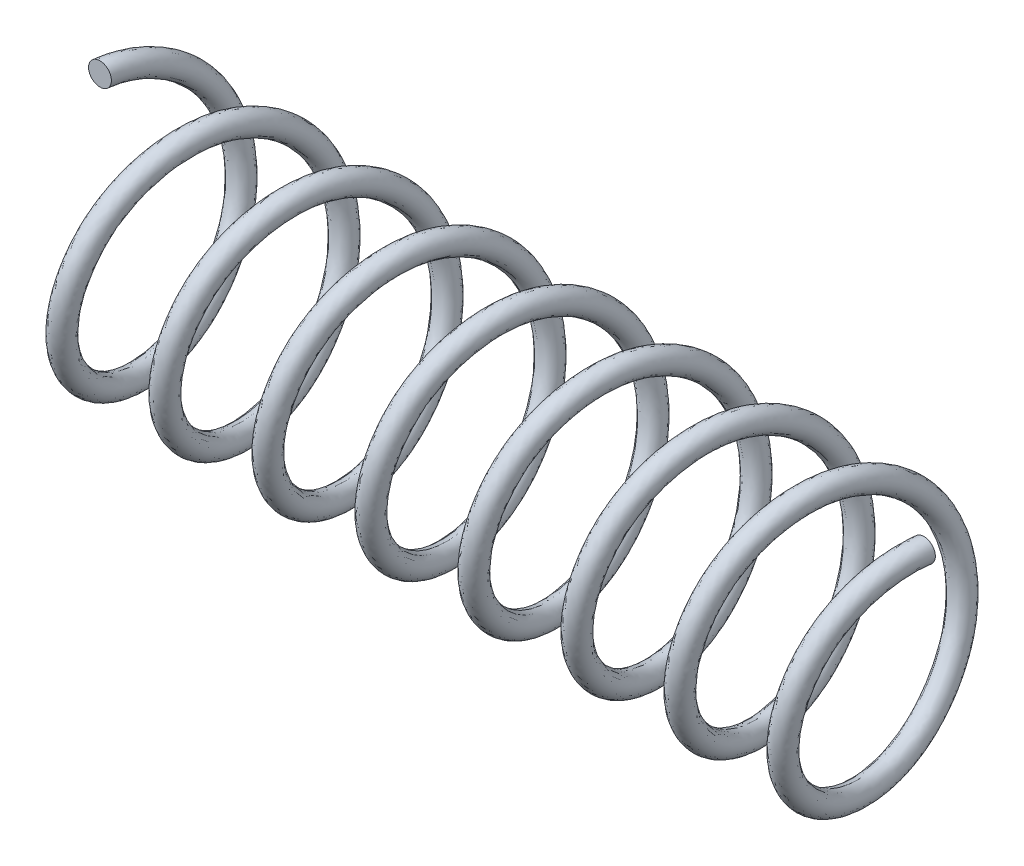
ISO-10303-21;
HEADER;
FILE_DESCRIPTION(('STEP AP214'),'2;1');
FILE_NAME('part.step','',(''),(''),'','','');
FILE_SCHEMA(('AUTOMOTIVE_DESIGN { 1 0 10303 214 1 1 1 1 }'));
ENDSEC;
DATA;
#1=APPLICATION_CONTEXT('core data for automotive mechanical design processes');
#2=APPLICATION_PROTOCOL_DEFINITION('international standard','automotive_design',2000,#1);
#3=PRODUCT_CONTEXT('',#1,'mechanical');
#4=PRODUCT('Part','Part','',(#3));
#5=PRODUCT_RELATED_PRODUCT_CATEGORY('part','',(#4));
#6=PRODUCT_DEFINITION_FORMATION('','',#4);
#7=PRODUCT_DEFINITION_CONTEXT('part definition',#1,'design');
#8=PRODUCT_DEFINITION('design','',#6,#7);
#9=PRODUCT_DEFINITION_SHAPE('','',#8);
#10=(LENGTH_UNIT() NAMED_UNIT(*) SI_UNIT(.MILLI.,.METRE.));
#11=(NAMED_UNIT(*) PLANE_ANGLE_UNIT() SI_UNIT($,.RADIAN.));
#12=(NAMED_UNIT(*) SI_UNIT($,.STERADIAN.) SOLID_ANGLE_UNIT());
#13=UNCERTAINTY_MEASURE_WITH_UNIT(LENGTH_MEASURE(1.E-05),#10,'distance_accuracy_value','');
#14=(GEOMETRIC_REPRESENTATION_CONTEXT(3) GLOBAL_UNCERTAINTY_ASSIGNED_CONTEXT((#13)) GLOBAL_UNIT_ASSIGNED_CONTEXT((#10,
#11,#12)) REPRESENTATION_CONTEXT('',''));
#15=CARTESIAN_POINT('',(0.,0.,0.));
#16=DIRECTION('',(0.,0.,1.));
#17=DIRECTION('',(1.,0.,0.));
#18=AXIS2_PLACEMENT_3D('',#15,#16,#17);
#19=CARTESIAN_POINT('',(-5.80000000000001,6.,-2.23454805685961E-13));
#20=DIRECTION('',(0.,1.1172740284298E-13,1.));
#21=DIRECTION('',(1.,0.,0.));
#22=AXIS2_PLACEMENT_3D('',#19,#20,#21);
#23=PLANE('',#22);
#24=CARTESIAN_POINT('',(-5.80000000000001,6.,-2.23454805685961E-13));
#25=DIRECTION('',(0.,1.1172740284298E-13,1.));
#26=DIRECTION('',(1.,0.,0.));
#27=AXIS2_PLACEMENT_3D('',#24,#25,#26);
#28=CIRCLE('',#27,0.199999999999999);
#29=CARTESIAN_POINT('',(-5.60000000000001,6.,-2.23454805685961E-13));
#30=VERTEX_POINT('',#29);
#31=EDGE_CURVE('E41',#30,#30,#28,.T.);
#32=ORIENTED_EDGE('',*,*,#31,.F.);
#33=EDGE_LOOP('',(#32));
#34=FACE_BOUND('',#33,.T.);
#35=ADVANCED_FACE('F34',(#34),#23,.F.);
#36=CARTESIAN_POINT('',(-20.2499998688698,6.,0.));
#37=DIRECTION('',(0.,0.,1.));
#38=DIRECTION('',(1.,0.,0.));
#39=AXIS2_PLACEMENT_3D('',#36,#37,#38);
#40=PLANE('',#39);
#41=CARTESIAN_POINT('',(-20.2499998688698,6.,0.));
#42=DIRECTION('',(0.,0.,1.));
#43=DIRECTION('',(1.,0.,0.));
#44=AXIS2_PLACEMENT_3D('',#41,#42,#43);
#45=CIRCLE('',#44,0.199999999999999);
#46=CARTESIAN_POINT('',(-20.0499998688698,6.,0.));
#47=VERTEX_POINT('',#46);
#48=EDGE_CURVE('E11',#47,#47,#45,.T.);
#49=ORIENTED_EDGE('',*,*,#48,.T.);
#50=EDGE_LOOP('',(#49));
#51=FACE_BOUND('',#50,.T.);
#52=ADVANCED_FACE('F48',(#51),#40,.T.);
#53=CARTESIAN_POINT('',(-5.60000000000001,6.,-2.23454805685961E-13));
#54=CARTESIAN_POINT('',(-5.7505208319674,6.00000000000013,1.15470053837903));
#55=CARTESIAN_POINT('',(-5.90104166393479,5.0000000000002,1.73205080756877));
#56=CARTESIAN_POINT('',(-6.05156249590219,4.00000000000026,2.3094010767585));
#57=CARTESIAN_POINT('',(-6.20208332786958,3.00000000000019,1.73205080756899));
#58=CARTESIAN_POINT('',(-6.35260415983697,2.00000000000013,1.15470053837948));
#59=CARTESIAN_POINT('',(-6.50312499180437,2.,2.2369973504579E-13));
#60=CARTESIAN_POINT('',(-6.65364582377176,1.99999999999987,-1.15470053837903));
#61=CARTESIAN_POINT('',(-6.80416665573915,2.99999999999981,-1.73205080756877));
#62=CARTESIAN_POINT('',(-6.95468748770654,3.99999999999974,-2.3094010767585));
#63=CARTESIAN_POINT('',(-7.10520831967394,4.99999999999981,-1.73205080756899));
#64=CARTESIAN_POINT('',(-7.25572915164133,5.99999999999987,-1.15470053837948));
#65=CARTESIAN_POINT('',(-7.40624998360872,6.,-2.23454805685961E-13));
#66=CARTESIAN_POINT('',(-7.55677081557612,6.00000000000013,1.15470053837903));
#67=CARTESIAN_POINT('',(-7.70729164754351,5.0000000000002,1.73205080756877));
#68=CARTESIAN_POINT('',(-7.8578124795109,4.00000000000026,2.3094010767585));
#69=CARTESIAN_POINT('',(-8.0083333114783,3.00000000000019,1.73205080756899));
#70=CARTESIAN_POINT('',(-8.15885414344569,2.00000000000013,1.15470053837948));
#71=CARTESIAN_POINT('',(-8.30937497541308,2.,2.2369973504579E-13));
#72=CARTESIAN_POINT('',(-8.45989580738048,1.99999999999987,-1.15470053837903));
#73=CARTESIAN_POINT('',(-8.61041663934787,2.99999999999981,-1.73205080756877));
#74=CARTESIAN_POINT('',(-8.76093747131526,3.99999999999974,-2.3094010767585));
#75=CARTESIAN_POINT('',(-8.91145830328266,4.99999999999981,-1.73205080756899));
#76=CARTESIAN_POINT('',(-9.06197913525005,5.99999999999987,-1.15470053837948));
#77=CARTESIAN_POINT('',(-9.21249996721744,6.,-2.23454805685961E-13));
#78=CARTESIAN_POINT('',(-9.36302079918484,6.00000000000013,1.15470053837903));
#79=CARTESIAN_POINT('',(-9.51354163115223,5.00000000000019,1.73205080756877));
#80=CARTESIAN_POINT('',(-9.66406246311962,4.00000000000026,2.3094010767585));
#81=CARTESIAN_POINT('',(-9.81458329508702,3.00000000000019,1.73205080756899));
#82=CARTESIAN_POINT('',(-9.96510412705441,2.00000000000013,1.15470053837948));
#83=CARTESIAN_POINT('',(-10.1156249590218,2.,2.2369973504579E-13));
#84=CARTESIAN_POINT('',(-10.2661457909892,1.99999999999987,-1.15470053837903));
#85=CARTESIAN_POINT('',(-10.4166666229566,2.99999999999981,-1.73205080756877));
#86=CARTESIAN_POINT('',(-10.567187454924,3.99999999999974,-2.3094010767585));
#87=CARTESIAN_POINT('',(-10.7177082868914,4.99999999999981,-1.73205080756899));
#88=CARTESIAN_POINT('',(-10.8682291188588,5.99999999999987,-1.15470053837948));
#89=CARTESIAN_POINT('',(-11.0187499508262,6.,-2.23454805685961E-13));
#90=CARTESIAN_POINT('',(-11.1692707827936,6.00000000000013,1.15470053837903));
#91=CARTESIAN_POINT('',(-11.3197916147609,5.00000000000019,1.73205080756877));
#92=CARTESIAN_POINT('',(-11.4703124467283,4.00000000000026,2.3094010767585));
#93=CARTESIAN_POINT('',(-11.6208332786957,3.00000000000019,1.73205080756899));
#94=CARTESIAN_POINT('',(-11.7713541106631,2.00000000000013,1.15470053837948));
#95=CARTESIAN_POINT('',(-11.9218749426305,2.,2.2369973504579E-13));
#96=CARTESIAN_POINT('',(-12.0723957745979,1.99999999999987,-1.15470053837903));
#97=CARTESIAN_POINT('',(-12.2229166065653,2.99999999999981,-1.73205080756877));
#98=CARTESIAN_POINT('',(-12.3734374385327,3.99999999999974,-2.3094010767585));
#99=CARTESIAN_POINT('',(-12.5239582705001,4.99999999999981,-1.73205080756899));
#100=CARTESIAN_POINT('',(-12.6744791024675,5.99999999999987,-1.15470053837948));
#101=CARTESIAN_POINT('',(-12.8249999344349,6.,-2.23454805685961E-13));
#102=CARTESIAN_POINT('',(-12.9755207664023,6.00000000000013,1.15470053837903));
#103=CARTESIAN_POINT('',(-13.1260415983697,5.00000000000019,1.73205080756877));
#104=CARTESIAN_POINT('',(-13.2765624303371,4.00000000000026,2.3094010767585));
#105=CARTESIAN_POINT('',(-13.4270832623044,3.00000000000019,1.73205080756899));
#106=CARTESIAN_POINT('',(-13.5776040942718,2.00000000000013,1.15470053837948));
#107=CARTESIAN_POINT('',(-13.7281249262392,2.,2.2369973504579E-13));
#108=CARTESIAN_POINT('',(-13.8786457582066,1.99999999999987,-1.15470053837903));
#109=CARTESIAN_POINT('',(-14.029166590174,2.99999999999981,-1.73205080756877));
#110=CARTESIAN_POINT('',(-14.1796874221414,3.99999999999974,-2.3094010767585));
#111=CARTESIAN_POINT('',(-14.3302082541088,4.99999999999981,-1.73205080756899));
#112=CARTESIAN_POINT('',(-14.4807290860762,5.99999999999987,-1.15470053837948));
#113=CARTESIAN_POINT('',(-14.6312499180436,6.,-2.23454805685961E-13));
#114=CARTESIAN_POINT('',(-14.781770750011,6.00000000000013,1.15470053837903));
#115=CARTESIAN_POINT('',(-14.9322915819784,5.00000000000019,1.73205080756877));
#116=CARTESIAN_POINT('',(-15.0828124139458,4.00000000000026,2.3094010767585));
#117=CARTESIAN_POINT('',(-15.2333332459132,3.00000000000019,1.73205080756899));
#118=CARTESIAN_POINT('',(-15.3838540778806,2.00000000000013,1.15470053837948));
#119=CARTESIAN_POINT('',(-15.534374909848,2.,2.2369973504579E-13));
#120=CARTESIAN_POINT('',(-15.6848957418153,1.99999999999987,-1.15470053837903));
#121=CARTESIAN_POINT('',(-15.8354165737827,2.9999999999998,-1.73205080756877));
#122=CARTESIAN_POINT('',(-15.9859374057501,3.99999999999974,-2.3094010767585));
#123=CARTESIAN_POINT('',(-16.1364582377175,4.99999999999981,-1.73205080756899));
#124=CARTESIAN_POINT('',(-16.2869790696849,5.99999999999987,-1.15470053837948));
#125=CARTESIAN_POINT('',(-16.4374999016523,6.,-2.23454805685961E-13));
#126=CARTESIAN_POINT('',(-16.5880207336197,6.00000000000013,1.15470053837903));
#127=CARTESIAN_POINT('',(-16.7385415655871,5.00000000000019,1.73205080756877));
#128=CARTESIAN_POINT('',(-16.8890623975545,4.00000000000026,2.3094010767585));
#129=CARTESIAN_POINT('',(-17.0395832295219,3.00000000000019,1.73205080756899));
#130=CARTESIAN_POINT('',(-17.1901040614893,2.00000000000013,1.15470053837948));
#131=CARTESIAN_POINT('',(-17.3406248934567,2.,2.2369973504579E-13));
#132=CARTESIAN_POINT('',(-17.4911457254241,1.99999999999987,-1.15470053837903));
#133=CARTESIAN_POINT('',(-17.6416665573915,2.9999999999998,-1.73205080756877));
#134=CARTESIAN_POINT('',(-17.7921873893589,3.99999999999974,-2.3094010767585));
#135=CARTESIAN_POINT('',(-17.9427082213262,4.9999999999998,-1.73205080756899));
#136=CARTESIAN_POINT('',(-18.0932290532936,5.99999999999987,-1.15470053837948));
#137=CARTESIAN_POINT('',(-18.243749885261,6.,-2.23454805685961E-13));
#138=CARTESIAN_POINT('',(-18.3942707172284,6.00000000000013,1.15470053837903));
#139=CARTESIAN_POINT('',(-18.5447915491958,5.00000000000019,1.73205080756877));
#140=CARTESIAN_POINT('',(-18.6953123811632,4.00000000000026,2.3094010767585));
#141=CARTESIAN_POINT('',(-18.8458332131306,3.00000000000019,1.73205080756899));
#142=CARTESIAN_POINT('',(-18.996354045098,2.00000000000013,1.15470053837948));
#143=CARTESIAN_POINT('',(-19.1468748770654,2.,2.2369973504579E-13));
#144=CARTESIAN_POINT('',(-19.2973957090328,1.99999999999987,-1.15470053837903));
#145=CARTESIAN_POINT('',(-19.4479165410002,2.9999999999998,-1.73205080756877));
#146=CARTESIAN_POINT('',(-19.5984373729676,3.99999999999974,-2.3094010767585));
#147=CARTESIAN_POINT('',(-19.748958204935,4.9999999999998,-1.73205080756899));
#148=CARTESIAN_POINT('',(-19.8994790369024,5.99999999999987,-1.15470053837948));
#149=CARTESIAN_POINT('',(-20.0499998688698,6.,-2.23454805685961E-13));
#150=CARTESIAN_POINT('',(-5.60000000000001,6.4,-2.68145766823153E-13));
#151=CARTESIAN_POINT('',(-5.7505208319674,6.40000000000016,1.38564064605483));
#152=CARTESIAN_POINT('',(-5.90104166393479,5.20000000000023,2.07846096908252));
#153=CARTESIAN_POINT('',(-6.05156249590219,4.00000000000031,2.7712812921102));
#154=CARTESIAN_POINT('',(-6.20208332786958,2.80000000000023,2.07846096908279));
#155=CARTESIAN_POINT('',(-6.35260415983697,1.60000000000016,1.38564064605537));
#156=CARTESIAN_POINT('',(-6.50312499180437,1.6,2.68439682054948E-13));
#157=CARTESIAN_POINT('',(-6.65364582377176,1.59999999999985,-1.38564064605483));
#158=CARTESIAN_POINT('',(-6.80416665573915,2.79999999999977,-2.07846096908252));
#159=CARTESIAN_POINT('',(-6.95468748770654,3.99999999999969,-2.7712812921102));
#160=CARTESIAN_POINT('',(-7.10520831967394,5.19999999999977,-2.07846096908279));
#161=CARTESIAN_POINT('',(-7.25572915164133,6.39999999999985,-1.38564064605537));
#162=CARTESIAN_POINT('',(-7.40624998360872,6.4,-2.68145766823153E-13));
#163=CARTESIAN_POINT('',(-7.55677081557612,6.40000000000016,1.38564064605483));
#164=CARTESIAN_POINT('',(-7.70729164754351,5.20000000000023,2.07846096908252));
#165=CARTESIAN_POINT('',(-7.85781247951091,4.00000000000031,2.7712812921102));
#166=CARTESIAN_POINT('',(-8.0083333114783,2.80000000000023,2.07846096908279));
#167=CARTESIAN_POINT('',(-8.15885414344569,1.60000000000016,1.38564064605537));
#168=CARTESIAN_POINT('',(-8.30937497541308,1.6,2.68439682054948E-13));
#169=CARTESIAN_POINT('',(-8.45989580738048,1.59999999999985,-1.38564064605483));
#170=CARTESIAN_POINT('',(-8.61041663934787,2.79999999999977,-2.07846096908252));
#171=CARTESIAN_POINT('',(-8.76093747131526,3.99999999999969,-2.7712812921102));
#172=CARTESIAN_POINT('',(-8.91145830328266,5.19999999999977,-2.07846096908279));
#173=CARTESIAN_POINT('',(-9.06197913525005,6.39999999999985,-1.38564064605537));
#174=CARTESIAN_POINT('',(-9.21249996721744,6.4,-2.68145766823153E-13));
#175=CARTESIAN_POINT('',(-9.36302079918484,6.40000000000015,1.38564064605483));
#176=CARTESIAN_POINT('',(-9.51354163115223,5.20000000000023,2.07846096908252));
#177=CARTESIAN_POINT('',(-9.66406246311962,4.00000000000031,2.7712812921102));
#178=CARTESIAN_POINT('',(-9.81458329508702,2.80000000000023,2.07846096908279));
#179=CARTESIAN_POINT('',(-9.96510412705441,1.60000000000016,1.38564064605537));
#180=CARTESIAN_POINT('',(-10.1156249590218,1.6,2.68439682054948E-13));
#181=CARTESIAN_POINT('',(-10.2661457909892,1.59999999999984,-1.38564064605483));
#182=CARTESIAN_POINT('',(-10.4166666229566,2.79999999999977,-2.07846096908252));
#183=CARTESIAN_POINT('',(-10.567187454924,3.99999999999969,-2.7712812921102));
#184=CARTESIAN_POINT('',(-10.7177082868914,5.19999999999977,-2.07846096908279));
#185=CARTESIAN_POINT('',(-10.8682291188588,6.39999999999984,-1.38564064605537));
#186=CARTESIAN_POINT('',(-11.0187499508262,6.4,-2.68145766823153E-13));
#187=CARTESIAN_POINT('',(-11.1692707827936,6.40000000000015,1.38564064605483));
#188=CARTESIAN_POINT('',(-11.3197916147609,5.20000000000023,2.07846096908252));
#189=CARTESIAN_POINT('',(-11.4703124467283,4.00000000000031,2.7712812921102));
#190=CARTESIAN_POINT('',(-11.6208332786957,2.80000000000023,2.07846096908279));
#191=CARTESIAN_POINT('',(-11.7713541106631,1.60000000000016,1.38564064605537));
#192=CARTESIAN_POINT('',(-11.9218749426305,1.6,2.68439682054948E-13));
#193=CARTESIAN_POINT('',(-12.0723957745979,1.59999999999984,-1.38564064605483));
#194=CARTESIAN_POINT('',(-12.2229166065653,2.79999999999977,-2.07846096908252));
#195=CARTESIAN_POINT('',(-12.3734374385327,3.99999999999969,-2.7712812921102));
#196=CARTESIAN_POINT('',(-12.5239582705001,5.19999999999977,-2.07846096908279));
#197=CARTESIAN_POINT('',(-12.6744791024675,6.39999999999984,-1.38564064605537));
#198=CARTESIAN_POINT('',(-12.8249999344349,6.4,-2.68145766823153E-13));
#199=CARTESIAN_POINT('',(-12.9755207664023,6.40000000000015,1.38564064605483));
#200=CARTESIAN_POINT('',(-13.1260415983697,5.20000000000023,2.07846096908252));
#201=CARTESIAN_POINT('',(-13.2765624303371,4.00000000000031,2.7712812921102));
#202=CARTESIAN_POINT('',(-13.4270832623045,2.80000000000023,2.07846096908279));
#203=CARTESIAN_POINT('',(-13.5776040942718,1.60000000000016,1.38564064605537));
#204=CARTESIAN_POINT('',(-13.7281249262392,1.6,2.68439682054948E-13));
#205=CARTESIAN_POINT('',(-13.8786457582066,1.59999999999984,-1.38564064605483));
#206=CARTESIAN_POINT('',(-14.029166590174,2.79999999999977,-2.07846096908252));
#207=CARTESIAN_POINT('',(-14.1796874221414,3.99999999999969,-2.7712812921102));
#208=CARTESIAN_POINT('',(-14.3302082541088,5.19999999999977,-2.07846096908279));
#209=CARTESIAN_POINT('',(-14.4807290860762,6.39999999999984,-1.38564064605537));
#210=CARTESIAN_POINT('',(-14.6312499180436,6.4,-2.68145766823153E-13));
#211=CARTESIAN_POINT('',(-14.781770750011,6.40000000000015,1.38564064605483));
#212=CARTESIAN_POINT('',(-14.9322915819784,5.20000000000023,2.07846096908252));
#213=CARTESIAN_POINT('',(-15.0828124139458,4.00000000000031,2.7712812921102));
#214=CARTESIAN_POINT('',(-15.2333332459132,2.80000000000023,2.07846096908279));
#215=CARTESIAN_POINT('',(-15.3838540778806,1.60000000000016,1.38564064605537));
#216=CARTESIAN_POINT('',(-15.534374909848,1.6,2.68439682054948E-13));
#217=CARTESIAN_POINT('',(-15.6848957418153,1.59999999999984,-1.38564064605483));
#218=CARTESIAN_POINT('',(-15.8354165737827,2.79999999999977,-2.07846096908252));
#219=CARTESIAN_POINT('',(-15.9859374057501,3.99999999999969,-2.7712812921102));
#220=CARTESIAN_POINT('',(-16.1364582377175,5.19999999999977,-2.07846096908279));
#221=CARTESIAN_POINT('',(-16.2869790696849,6.39999999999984,-1.38564064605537));
#222=CARTESIAN_POINT('',(-16.4374999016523,6.4,-2.68145766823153E-13));
#223=CARTESIAN_POINT('',(-16.5880207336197,6.40000000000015,1.38564064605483));
#224=CARTESIAN_POINT('',(-16.7385415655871,5.20000000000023,2.07846096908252));
#225=CARTESIAN_POINT('',(-16.8890623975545,4.00000000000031,2.7712812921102));
#226=CARTESIAN_POINT('',(-17.0395832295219,2.80000000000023,2.07846096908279));
#227=CARTESIAN_POINT('',(-17.1901040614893,1.60000000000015,1.38564064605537));
#228=CARTESIAN_POINT('',(-17.3406248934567,1.6,2.68439682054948E-13));
#229=CARTESIAN_POINT('',(-17.4911457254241,1.59999999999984,-1.38564064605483));
#230=CARTESIAN_POINT('',(-17.6416665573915,2.79999999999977,-2.07846096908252));
#231=CARTESIAN_POINT('',(-17.7921873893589,3.99999999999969,-2.7712812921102));
#232=CARTESIAN_POINT('',(-17.9427082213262,5.19999999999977,-2.07846096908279));
#233=CARTESIAN_POINT('',(-18.0932290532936,6.39999999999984,-1.38564064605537));
#234=CARTESIAN_POINT('',(-18.243749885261,6.4,-2.68145766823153E-13));
#235=CARTESIAN_POINT('',(-18.3942707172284,6.40000000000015,1.38564064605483));
#236=CARTESIAN_POINT('',(-18.5447915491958,5.20000000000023,2.07846096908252));
#237=CARTESIAN_POINT('',(-18.6953123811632,4.00000000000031,2.7712812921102));
#238=CARTESIAN_POINT('',(-18.8458332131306,2.80000000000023,2.07846096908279));
#239=CARTESIAN_POINT('',(-18.996354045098,1.60000000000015,1.38564064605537));
#240=CARTESIAN_POINT('',(-19.1468748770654,1.6,2.68439682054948E-13));
#241=CARTESIAN_POINT('',(-19.2973957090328,1.59999999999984,-1.38564064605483));
#242=CARTESIAN_POINT('',(-19.4479165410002,2.79999999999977,-2.07846096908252));
#243=CARTESIAN_POINT('',(-19.5984373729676,3.99999999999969,-2.7712812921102));
#244=CARTESIAN_POINT('',(-19.748958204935,5.19999999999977,-2.07846096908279));
#245=CARTESIAN_POINT('',(-19.8994790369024,6.39999999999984,-1.38564064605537));
#246=CARTESIAN_POINT('',(-20.0499998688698,6.4,-2.68145766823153E-13));
#247=CARTESIAN_POINT('',(-6.,6.4,-2.68145766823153E-13));
#248=CARTESIAN_POINT('',(-6.1505208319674,6.40000000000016,1.38564064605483));
#249=CARTESIAN_POINT('',(-6.30104166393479,5.20000000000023,2.07846096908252));
#250=CARTESIAN_POINT('',(-6.45156249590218,4.00000000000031,2.7712812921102));
#251=CARTESIAN_POINT('',(-6.60208332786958,2.80000000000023,2.07846096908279));
#252=CARTESIAN_POINT('',(-6.75260415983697,1.60000000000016,1.38564064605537));
#253=CARTESIAN_POINT('',(-6.90312499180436,1.6,2.68439682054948E-13));
#254=CARTESIAN_POINT('',(-7.05364582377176,1.59999999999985,-1.38564064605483));
#255=CARTESIAN_POINT('',(-7.20416665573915,2.79999999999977,-2.07846096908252));
#256=CARTESIAN_POINT('',(-7.35468748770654,3.99999999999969,-2.7712812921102));
#257=CARTESIAN_POINT('',(-7.50520831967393,5.19999999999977,-2.07846096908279));
#258=CARTESIAN_POINT('',(-7.65572915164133,6.39999999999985,-1.38564064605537));
#259=CARTESIAN_POINT('',(-7.80624998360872,6.4,-2.68145766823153E-13));
#260=CARTESIAN_POINT('',(-7.95677081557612,6.40000000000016,1.38564064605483));
#261=CARTESIAN_POINT('',(-8.10729164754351,5.20000000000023,2.07846096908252));
#262=CARTESIAN_POINT('',(-8.2578124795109,4.00000000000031,2.7712812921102));
#263=CARTESIAN_POINT('',(-8.40833331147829,2.80000000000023,2.07846096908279));
#264=CARTESIAN_POINT('',(-8.55885414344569,1.60000000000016,1.38564064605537));
#265=CARTESIAN_POINT('',(-8.70937497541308,1.6,2.68439682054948E-13));
#266=CARTESIAN_POINT('',(-8.85989580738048,1.59999999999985,-1.38564064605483));
#267=CARTESIAN_POINT('',(-9.01041663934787,2.79999999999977,-2.07846096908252));
#268=CARTESIAN_POINT('',(-9.16093747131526,3.99999999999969,-2.7712812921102));
#269=CARTESIAN_POINT('',(-9.31145830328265,5.19999999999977,-2.07846096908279));
#270=CARTESIAN_POINT('',(-9.46197913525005,6.39999999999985,-1.38564064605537));
#271=CARTESIAN_POINT('',(-9.61249996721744,6.4,-2.68145766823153E-13));
#272=CARTESIAN_POINT('',(-9.76302079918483,6.40000000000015,1.38564064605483));
#273=CARTESIAN_POINT('',(-9.91354163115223,5.20000000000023,2.07846096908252));
#274=CARTESIAN_POINT('',(-10.0640624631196,4.00000000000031,2.7712812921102));
#275=CARTESIAN_POINT('',(-10.214583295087,2.80000000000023,2.07846096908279));
#276=CARTESIAN_POINT('',(-10.3651041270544,1.60000000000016,1.38564064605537));
#277=CARTESIAN_POINT('',(-10.5156249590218,1.6,2.68439682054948E-13));
#278=CARTESIAN_POINT('',(-10.6661457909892,1.59999999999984,-1.38564064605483));
#279=CARTESIAN_POINT('',(-10.8166666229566,2.79999999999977,-2.07846096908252));
#280=CARTESIAN_POINT('',(-10.967187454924,3.99999999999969,-2.7712812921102));
#281=CARTESIAN_POINT('',(-11.1177082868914,5.19999999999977,-2.07846096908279));
#282=CARTESIAN_POINT('',(-11.2682291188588,6.39999999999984,-1.38564064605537));
#283=CARTESIAN_POINT('',(-11.4187499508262,6.4,-2.68145766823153E-13));
#284=CARTESIAN_POINT('',(-11.5692707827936,6.40000000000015,1.38564064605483));
#285=CARTESIAN_POINT('',(-11.7197916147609,5.20000000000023,2.07846096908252));
#286=CARTESIAN_POINT('',(-11.8703124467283,4.00000000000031,2.7712812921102));
#287=CARTESIAN_POINT('',(-12.0208332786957,2.80000000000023,2.07846096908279));
#288=CARTESIAN_POINT('',(-12.1713541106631,1.60000000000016,1.38564064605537));
#289=CARTESIAN_POINT('',(-12.3218749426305,1.6,2.68439682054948E-13));
#290=CARTESIAN_POINT('',(-12.4723957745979,1.59999999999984,-1.38564064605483));
#291=CARTESIAN_POINT('',(-12.6229166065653,2.79999999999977,-2.07846096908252));
#292=CARTESIAN_POINT('',(-12.7734374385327,3.99999999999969,-2.7712812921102));
#293=CARTESIAN_POINT('',(-12.9239582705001,5.19999999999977,-2.07846096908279));
#294=CARTESIAN_POINT('',(-13.0744791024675,6.39999999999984,-1.38564064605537));
#295=CARTESIAN_POINT('',(-13.2249999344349,6.4,-2.68145766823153E-13));
#296=CARTESIAN_POINT('',(-13.3755207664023,6.40000000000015,1.38564064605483));
#297=CARTESIAN_POINT('',(-13.5260415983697,5.20000000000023,2.07846096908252));
#298=CARTESIAN_POINT('',(-13.6765624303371,4.00000000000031,2.7712812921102));
#299=CARTESIAN_POINT('',(-13.8270832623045,2.80000000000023,2.07846096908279));
#300=CARTESIAN_POINT('',(-13.9776040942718,1.60000000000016,1.38564064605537));
#301=CARTESIAN_POINT('',(-14.1281249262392,1.6,2.68439682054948E-13));
#302=CARTESIAN_POINT('',(-14.2786457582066,1.59999999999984,-1.38564064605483));
#303=CARTESIAN_POINT('',(-14.429166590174,2.79999999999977,-2.07846096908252));
#304=CARTESIAN_POINT('',(-14.5796874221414,3.99999999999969,-2.7712812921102));
#305=CARTESIAN_POINT('',(-14.7302082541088,5.19999999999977,-2.07846096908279));
#306=CARTESIAN_POINT('',(-14.8807290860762,6.39999999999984,-1.38564064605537));
#307=CARTESIAN_POINT('',(-15.0312499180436,6.4,-2.68145766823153E-13));
#308=CARTESIAN_POINT('',(-15.181770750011,6.40000000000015,1.38564064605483));
#309=CARTESIAN_POINT('',(-15.3322915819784,5.20000000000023,2.07846096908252));
#310=CARTESIAN_POINT('',(-15.4828124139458,4.00000000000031,2.7712812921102));
#311=CARTESIAN_POINT('',(-15.6333332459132,2.80000000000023,2.07846096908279));
#312=CARTESIAN_POINT('',(-15.7838540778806,1.60000000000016,1.38564064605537));
#313=CARTESIAN_POINT('',(-15.934374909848,1.6,2.68439682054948E-13));
#314=CARTESIAN_POINT('',(-16.0848957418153,1.59999999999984,-1.38564064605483));
#315=CARTESIAN_POINT('',(-16.2354165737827,2.79999999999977,-2.07846096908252));
#316=CARTESIAN_POINT('',(-16.3859374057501,3.99999999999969,-2.7712812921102));
#317=CARTESIAN_POINT('',(-16.5364582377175,5.19999999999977,-2.07846096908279));
#318=CARTESIAN_POINT('',(-16.6869790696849,6.39999999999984,-1.38564064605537));
#319=CARTESIAN_POINT('',(-16.8374999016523,6.4,-2.68145766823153E-13));
#320=CARTESIAN_POINT('',(-16.9880207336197,6.40000000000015,1.38564064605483));
#321=CARTESIAN_POINT('',(-17.1385415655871,5.20000000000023,2.07846096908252));
#322=CARTESIAN_POINT('',(-17.2890623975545,4.00000000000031,2.7712812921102));
#323=CARTESIAN_POINT('',(-17.4395832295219,2.80000000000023,2.07846096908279));
#324=CARTESIAN_POINT('',(-17.5901040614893,1.60000000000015,1.38564064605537));
#325=CARTESIAN_POINT('',(-17.7406248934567,1.6,2.68439682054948E-13));
#326=CARTESIAN_POINT('',(-17.8911457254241,1.59999999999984,-1.38564064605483));
#327=CARTESIAN_POINT('',(-18.0416665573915,2.79999999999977,-2.07846096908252));
#328=CARTESIAN_POINT('',(-18.1921873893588,3.99999999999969,-2.7712812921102));
#329=CARTESIAN_POINT('',(-18.3427082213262,5.19999999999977,-2.07846096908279));
#330=CARTESIAN_POINT('',(-18.4932290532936,6.39999999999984,-1.38564064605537));
#331=CARTESIAN_POINT('',(-18.643749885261,6.4,-2.68145766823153E-13));
#332=CARTESIAN_POINT('',(-18.7942707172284,6.40000000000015,1.38564064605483));
#333=CARTESIAN_POINT('',(-18.9447915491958,5.20000000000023,2.07846096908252));
#334=CARTESIAN_POINT('',(-19.0953123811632,4.00000000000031,2.7712812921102));
#335=CARTESIAN_POINT('',(-19.2458332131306,2.80000000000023,2.07846096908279));
#336=CARTESIAN_POINT('',(-19.396354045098,1.60000000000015,1.38564064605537));
#337=CARTESIAN_POINT('',(-19.5468748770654,1.6,2.68439682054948E-13));
#338=CARTESIAN_POINT('',(-19.6973957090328,1.59999999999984,-1.38564064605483));
#339=CARTESIAN_POINT('',(-19.8479165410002,2.79999999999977,-2.07846096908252));
#340=CARTESIAN_POINT('',(-19.9984373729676,3.99999999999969,-2.7712812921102));
#341=CARTESIAN_POINT('',(-20.148958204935,5.19999999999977,-2.07846096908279));
#342=CARTESIAN_POINT('',(-20.2994790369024,6.39999999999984,-1.38564064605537));
#343=CARTESIAN_POINT('',(-20.4499998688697,6.4,-2.68145766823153E-13));
#344=CARTESIAN_POINT('',(-6.,6.,-2.23454805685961E-13));
#345=CARTESIAN_POINT('',(-6.1505208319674,6.00000000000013,1.15470053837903));
#346=CARTESIAN_POINT('',(-6.30104166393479,5.0000000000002,1.73205080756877));
#347=CARTESIAN_POINT('',(-6.45156249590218,4.00000000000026,2.3094010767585));
#348=CARTESIAN_POINT('',(-6.60208332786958,3.00000000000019,1.73205080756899));
#349=CARTESIAN_POINT('',(-6.75260415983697,2.00000000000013,1.15470053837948));
#350=CARTESIAN_POINT('',(-6.90312499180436,2.,2.2369973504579E-13));
#351=CARTESIAN_POINT('',(-7.05364582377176,1.99999999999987,-1.15470053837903));
#352=CARTESIAN_POINT('',(-7.20416665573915,2.99999999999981,-1.73205080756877));
#353=CARTESIAN_POINT('',(-7.35468748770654,3.99999999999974,-2.3094010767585));
#354=CARTESIAN_POINT('',(-7.50520831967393,4.99999999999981,-1.73205080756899));
#355=CARTESIAN_POINT('',(-7.65572915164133,5.99999999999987,-1.15470053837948));
#356=CARTESIAN_POINT('',(-7.80624998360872,6.,-2.23454805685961E-13));
#357=CARTESIAN_POINT('',(-7.95677081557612,6.00000000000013,1.15470053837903));
#358=CARTESIAN_POINT('',(-8.10729164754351,5.0000000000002,1.73205080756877));
#359=CARTESIAN_POINT('',(-8.2578124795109,4.00000000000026,2.3094010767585));
#360=CARTESIAN_POINT('',(-8.40833331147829,3.00000000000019,1.73205080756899));
#361=CARTESIAN_POINT('',(-8.55885414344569,2.00000000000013,1.15470053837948));
#362=CARTESIAN_POINT('',(-8.70937497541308,2.,2.2369973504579E-13));
#363=CARTESIAN_POINT('',(-8.85989580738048,1.99999999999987,-1.15470053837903));
#364=CARTESIAN_POINT('',(-9.01041663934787,2.99999999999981,-1.73205080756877));
#365=CARTESIAN_POINT('',(-9.16093747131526,3.99999999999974,-2.3094010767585));
#366=CARTESIAN_POINT('',(-9.31145830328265,4.99999999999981,-1.73205080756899));
#367=CARTESIAN_POINT('',(-9.46197913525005,5.99999999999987,-1.15470053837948));
#368=CARTESIAN_POINT('',(-9.61249996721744,6.,-2.23454805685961E-13));
#369=CARTESIAN_POINT('',(-9.76302079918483,6.00000000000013,1.15470053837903));
#370=CARTESIAN_POINT('',(-9.91354163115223,5.00000000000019,1.73205080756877));
#371=CARTESIAN_POINT('',(-10.0640624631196,4.00000000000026,2.3094010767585));
#372=CARTESIAN_POINT('',(-10.214583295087,3.00000000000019,1.73205080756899));
#373=CARTESIAN_POINT('',(-10.3651041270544,2.00000000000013,1.15470053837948));
#374=CARTESIAN_POINT('',(-10.5156249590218,2.,2.2369973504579E-13));
#375=CARTESIAN_POINT('',(-10.6661457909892,1.99999999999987,-1.15470053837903));
#376=CARTESIAN_POINT('',(-10.8166666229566,2.99999999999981,-1.73205080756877));
#377=CARTESIAN_POINT('',(-10.967187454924,3.99999999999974,-2.3094010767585));
#378=CARTESIAN_POINT('',(-11.1177082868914,4.99999999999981,-1.73205080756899));
#379=CARTESIAN_POINT('',(-11.2682291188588,5.99999999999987,-1.15470053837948));
#380=CARTESIAN_POINT('',(-11.4187499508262,6.,-2.23454805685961E-13));
#381=CARTESIAN_POINT('',(-11.5692707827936,6.00000000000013,1.15470053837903));
#382=CARTESIAN_POINT('',(-11.7197916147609,5.00000000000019,1.73205080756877));
#383=CARTESIAN_POINT('',(-11.8703124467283,4.00000000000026,2.3094010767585));
#384=CARTESIAN_POINT('',(-12.0208332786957,3.00000000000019,1.73205080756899));
#385=CARTESIAN_POINT('',(-12.1713541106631,2.00000000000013,1.15470053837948));
#386=CARTESIAN_POINT('',(-12.3218749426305,2.,2.2369973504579E-13));
#387=CARTESIAN_POINT('',(-12.4723957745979,1.99999999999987,-1.15470053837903));
#388=CARTESIAN_POINT('',(-12.6229166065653,2.99999999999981,-1.73205080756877));
#389=CARTESIAN_POINT('',(-12.7734374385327,3.99999999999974,-2.3094010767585));
#390=CARTESIAN_POINT('',(-12.9239582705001,4.99999999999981,-1.73205080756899));
#391=CARTESIAN_POINT('',(-13.0744791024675,5.99999999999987,-1.15470053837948));
#392=CARTESIAN_POINT('',(-13.2249999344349,6.,-2.23454805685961E-13));
#393=CARTESIAN_POINT('',(-13.3755207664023,6.00000000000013,1.15470053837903));
#394=CARTESIAN_POINT('',(-13.5260415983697,5.00000000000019,1.73205080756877));
#395=CARTESIAN_POINT('',(-13.6765624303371,4.00000000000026,2.3094010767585));
#396=CARTESIAN_POINT('',(-13.8270832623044,3.00000000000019,1.73205080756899));
#397=CARTESIAN_POINT('',(-13.9776040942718,2.00000000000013,1.15470053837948));
#398=CARTESIAN_POINT('',(-14.1281249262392,2.,2.2369973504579E-13));
#399=CARTESIAN_POINT('',(-14.2786457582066,1.99999999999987,-1.15470053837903));
#400=CARTESIAN_POINT('',(-14.429166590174,2.99999999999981,-1.73205080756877));
#401=CARTESIAN_POINT('',(-14.5796874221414,3.99999999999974,-2.3094010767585));
#402=CARTESIAN_POINT('',(-14.7302082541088,4.99999999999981,-1.73205080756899));
#403=CARTESIAN_POINT('',(-14.8807290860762,5.99999999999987,-1.15470053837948));
#404=CARTESIAN_POINT('',(-15.0312499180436,6.,-2.23454805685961E-13));
#405=CARTESIAN_POINT('',(-15.181770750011,6.00000000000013,1.15470053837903));
#406=CARTESIAN_POINT('',(-15.3322915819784,5.00000000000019,1.73205080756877));
#407=CARTESIAN_POINT('',(-15.4828124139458,4.00000000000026,2.3094010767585));
#408=CARTESIAN_POINT('',(-15.6333332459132,3.00000000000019,1.73205080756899));
#409=CARTESIAN_POINT('',(-15.7838540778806,2.00000000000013,1.15470053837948));
#410=CARTESIAN_POINT('',(-15.934374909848,2.,2.2369973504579E-13));
#411=CARTESIAN_POINT('',(-16.0848957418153,1.99999999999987,-1.15470053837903));
#412=CARTESIAN_POINT('',(-16.2354165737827,2.9999999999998,-1.73205080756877));
#413=CARTESIAN_POINT('',(-16.3859374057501,3.99999999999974,-2.3094010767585));
#414=CARTESIAN_POINT('',(-16.5364582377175,4.99999999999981,-1.73205080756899));
#415=CARTESIAN_POINT('',(-16.6869790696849,5.99999999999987,-1.15470053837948));
#416=CARTESIAN_POINT('',(-16.8374999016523,6.,-2.23454805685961E-13));
#417=CARTESIAN_POINT('',(-16.9880207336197,6.00000000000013,1.15470053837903));
#418=CARTESIAN_POINT('',(-17.1385415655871,5.00000000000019,1.73205080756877));
#419=CARTESIAN_POINT('',(-17.2890623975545,4.00000000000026,2.3094010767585));
#420=CARTESIAN_POINT('',(-17.4395832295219,3.00000000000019,1.73205080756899));
#421=CARTESIAN_POINT('',(-17.5901040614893,2.00000000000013,1.15470053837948));
#422=CARTESIAN_POINT('',(-17.7406248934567,2.,2.2369973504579E-13));
#423=CARTESIAN_POINT('',(-17.8911457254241,1.99999999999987,-1.15470053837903));
#424=CARTESIAN_POINT('',(-18.0416665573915,2.9999999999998,-1.73205080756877));
#425=CARTESIAN_POINT('',(-18.1921873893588,3.99999999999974,-2.3094010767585));
#426=CARTESIAN_POINT('',(-18.3427082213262,4.9999999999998,-1.73205080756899));
#427=CARTESIAN_POINT('',(-18.4932290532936,5.99999999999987,-1.15470053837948));
#428=CARTESIAN_POINT('',(-18.643749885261,6.,-2.23454805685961E-13));
#429=CARTESIAN_POINT('',(-18.7942707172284,6.00000000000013,1.15470053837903));
#430=CARTESIAN_POINT('',(-18.9447915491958,5.00000000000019,1.73205080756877));
#431=CARTESIAN_POINT('',(-19.0953123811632,4.00000000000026,2.3094010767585));
#432=CARTESIAN_POINT('',(-19.2458332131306,3.00000000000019,1.73205080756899));
#433=CARTESIAN_POINT('',(-19.396354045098,2.00000000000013,1.15470053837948));
#434=CARTESIAN_POINT('',(-19.5468748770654,2.,2.2369973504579E-13));
#435=CARTESIAN_POINT('',(-19.6973957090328,1.99999999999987,-1.15470053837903));
#436=CARTESIAN_POINT('',(-19.8479165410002,2.9999999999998,-1.73205080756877));
#437=CARTESIAN_POINT('',(-19.9984373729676,3.99999999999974,-2.3094010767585));
#438=CARTESIAN_POINT('',(-20.148958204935,4.9999999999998,-1.73205080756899));
#439=CARTESIAN_POINT('',(-20.2994790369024,5.99999999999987,-1.15470053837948));
#440=CARTESIAN_POINT('',(-20.4499998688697,6.,-2.23454805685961E-13));
#441=CARTESIAN_POINT('',(-6.,5.6,-1.78763844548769E-13));
#442=CARTESIAN_POINT('',(-6.1505208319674,5.60000000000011,0.923760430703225));
#443=CARTESIAN_POINT('',(-6.30104166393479,4.80000000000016,1.38564064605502));
#444=CARTESIAN_POINT('',(-6.45156249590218,4.00000000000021,1.84752086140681));
#445=CARTESIAN_POINT('',(-6.60208332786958,3.20000000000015,1.38564064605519));
#446=CARTESIAN_POINT('',(-6.75260415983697,2.4000000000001,0.923760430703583));
#447=CARTESIAN_POINT('',(-6.90312499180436,2.4,1.78959788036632E-13));
#448=CARTESIAN_POINT('',(-7.05364582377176,2.39999999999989,-0.923760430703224));
#449=CARTESIAN_POINT('',(-7.20416665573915,3.19999999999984,-1.38564064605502));
#450=CARTESIAN_POINT('',(-7.35468748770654,3.99999999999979,-1.84752086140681));
#451=CARTESIAN_POINT('',(-7.50520831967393,4.79999999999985,-1.3856406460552));
#452=CARTESIAN_POINT('',(-7.65572915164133,5.5999999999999,-0.923760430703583));
#453=CARTESIAN_POINT('',(-7.80624998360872,5.6,-1.78763844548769E-13));
#454=CARTESIAN_POINT('',(-7.95677081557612,5.60000000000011,0.923760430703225));
#455=CARTESIAN_POINT('',(-8.10729164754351,4.80000000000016,1.38564064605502));
#456=CARTESIAN_POINT('',(-8.2578124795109,4.00000000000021,1.84752086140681));
#457=CARTESIAN_POINT('',(-8.40833331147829,3.20000000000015,1.38564064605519));
#458=CARTESIAN_POINT('',(-8.55885414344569,2.4000000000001,0.923760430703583));
#459=CARTESIAN_POINT('',(-8.70937497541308,2.4,1.78959788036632E-13));
#460=CARTESIAN_POINT('',(-8.85989580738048,2.39999999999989,-0.923760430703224));
#461=CARTESIAN_POINT('',(-9.01041663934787,3.19999999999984,-1.38564064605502));
#462=CARTESIAN_POINT('',(-9.16093747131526,3.99999999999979,-1.84752086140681));
#463=CARTESIAN_POINT('',(-9.31145830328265,4.79999999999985,-1.3856406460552));
#464=CARTESIAN_POINT('',(-9.46197913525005,5.5999999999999,-0.923760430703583));
#465=CARTESIAN_POINT('',(-9.61249996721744,5.6,-1.78763844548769E-13));
#466=CARTESIAN_POINT('',(-9.76302079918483,5.60000000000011,0.923760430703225));
#467=CARTESIAN_POINT('',(-9.91354163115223,4.80000000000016,1.38564064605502));
#468=CARTESIAN_POINT('',(-10.0640624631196,4.00000000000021,1.84752086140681));
#469=CARTESIAN_POINT('',(-10.214583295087,3.20000000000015,1.38564064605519));
#470=CARTESIAN_POINT('',(-10.3651041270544,2.4000000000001,0.923760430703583));
#471=CARTESIAN_POINT('',(-10.5156249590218,2.4,1.78959788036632E-13));
#472=CARTESIAN_POINT('',(-10.6661457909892,2.39999999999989,-0.923760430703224));
#473=CARTESIAN_POINT('',(-10.8166666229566,3.19999999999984,-1.38564064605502));
#474=CARTESIAN_POINT('',(-10.967187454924,3.99999999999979,-1.84752086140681));
#475=CARTESIAN_POINT('',(-11.1177082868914,4.79999999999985,-1.3856406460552));
#476=CARTESIAN_POINT('',(-11.2682291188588,5.5999999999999,-0.923760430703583));
#477=CARTESIAN_POINT('',(-11.4187499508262,5.6,-1.78763844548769E-13));
#478=CARTESIAN_POINT('',(-11.5692707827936,5.60000000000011,0.923760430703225));
#479=CARTESIAN_POINT('',(-11.7197916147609,4.80000000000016,1.38564064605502));
#480=CARTESIAN_POINT('',(-11.8703124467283,4.00000000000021,1.84752086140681));
#481=CARTESIAN_POINT('',(-12.0208332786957,3.20000000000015,1.38564064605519));
#482=CARTESIAN_POINT('',(-12.1713541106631,2.4000000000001,0.923760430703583));
#483=CARTESIAN_POINT('',(-12.3218749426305,2.4,1.78959788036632E-13));
#484=CARTESIAN_POINT('',(-12.4723957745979,2.39999999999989,-0.923760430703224));
#485=CARTESIAN_POINT('',(-12.6229166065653,3.19999999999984,-1.38564064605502));
#486=CARTESIAN_POINT('',(-12.7734374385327,3.99999999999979,-1.84752086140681));
#487=CARTESIAN_POINT('',(-12.9239582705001,4.79999999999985,-1.3856406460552));
#488=CARTESIAN_POINT('',(-13.0744791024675,5.5999999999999,-0.923760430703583));
#489=CARTESIAN_POINT('',(-13.2249999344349,5.6,-1.78763844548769E-13));
#490=CARTESIAN_POINT('',(-13.3755207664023,5.60000000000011,0.923760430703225));
#491=CARTESIAN_POINT('',(-13.5260415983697,4.80000000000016,1.38564064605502));
#492=CARTESIAN_POINT('',(-13.6765624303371,4.00000000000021,1.84752086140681));
#493=CARTESIAN_POINT('',(-13.8270832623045,3.20000000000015,1.38564064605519));
#494=CARTESIAN_POINT('',(-13.9776040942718,2.4000000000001,0.923760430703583));
#495=CARTESIAN_POINT('',(-14.1281249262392,2.4,1.78959788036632E-13));
#496=CARTESIAN_POINT('',(-14.2786457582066,2.39999999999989,-0.923760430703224));
#497=CARTESIAN_POINT('',(-14.429166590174,3.19999999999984,-1.38564064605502));
#498=CARTESIAN_POINT('',(-14.5796874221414,3.99999999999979,-1.84752086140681));
#499=CARTESIAN_POINT('',(-14.7302082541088,4.79999999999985,-1.3856406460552));
#500=CARTESIAN_POINT('',(-14.8807290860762,5.5999999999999,-0.923760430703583));
#501=CARTESIAN_POINT('',(-15.0312499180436,5.6,-1.78763844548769E-13));
#502=CARTESIAN_POINT('',(-15.181770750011,5.60000000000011,0.923760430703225));
#503=CARTESIAN_POINT('',(-15.3322915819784,4.80000000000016,1.38564064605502));
#504=CARTESIAN_POINT('',(-15.4828124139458,4.00000000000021,1.84752086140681));
#505=CARTESIAN_POINT('',(-15.6333332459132,3.20000000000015,1.38564064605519));
#506=CARTESIAN_POINT('',(-15.7838540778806,2.4000000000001,0.923760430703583));
#507=CARTESIAN_POINT('',(-15.934374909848,2.4,1.78959788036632E-13));
#508=CARTESIAN_POINT('',(-16.0848957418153,2.39999999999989,-0.923760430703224));
#509=CARTESIAN_POINT('',(-16.2354165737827,3.19999999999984,-1.38564064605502));
#510=CARTESIAN_POINT('',(-16.3859374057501,3.99999999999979,-1.84752086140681));
#511=CARTESIAN_POINT('',(-16.5364582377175,4.79999999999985,-1.3856406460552));
#512=CARTESIAN_POINT('',(-16.6869790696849,5.5999999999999,-0.923760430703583));
#513=CARTESIAN_POINT('',(-16.8374999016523,5.6,-1.78763844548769E-13));
#514=CARTESIAN_POINT('',(-16.9880207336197,5.60000000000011,0.923760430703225));
#515=CARTESIAN_POINT('',(-17.1385415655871,4.80000000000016,1.38564064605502));
#516=CARTESIAN_POINT('',(-17.2890623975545,4.00000000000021,1.84752086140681));
#517=CARTESIAN_POINT('',(-17.4395832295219,3.20000000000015,1.38564064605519));
#518=CARTESIAN_POINT('',(-17.5901040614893,2.4000000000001,0.923760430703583));
#519=CARTESIAN_POINT('',(-17.7406248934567,2.4,1.78959788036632E-13));
#520=CARTESIAN_POINT('',(-17.8911457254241,2.39999999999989,-0.923760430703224));
#521=CARTESIAN_POINT('',(-18.0416665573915,3.19999999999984,-1.38564064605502));
#522=CARTESIAN_POINT('',(-18.1921873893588,3.99999999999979,-1.84752086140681));
#523=CARTESIAN_POINT('',(-18.3427082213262,4.79999999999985,-1.3856406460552));
#524=CARTESIAN_POINT('',(-18.4932290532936,5.5999999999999,-0.923760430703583));
#525=CARTESIAN_POINT('',(-18.643749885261,5.6,-1.78763844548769E-13));
#526=CARTESIAN_POINT('',(-18.7942707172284,5.60000000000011,0.923760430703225));
#527=CARTESIAN_POINT('',(-18.9447915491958,4.80000000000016,1.38564064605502));
#528=CARTESIAN_POINT('',(-19.0953123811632,4.00000000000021,1.84752086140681));
#529=CARTESIAN_POINT('',(-19.2458332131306,3.20000000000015,1.38564064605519));
#530=CARTESIAN_POINT('',(-19.396354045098,2.4000000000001,0.923760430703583));
#531=CARTESIAN_POINT('',(-19.5468748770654,2.4,1.78959788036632E-13));
#532=CARTESIAN_POINT('',(-19.6973957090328,2.39999999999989,-0.923760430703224));
#533=CARTESIAN_POINT('',(-19.8479165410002,3.19999999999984,-1.38564064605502));
#534=CARTESIAN_POINT('',(-19.9984373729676,3.99999999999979,-1.84752086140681));
#535=CARTESIAN_POINT('',(-20.148958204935,4.79999999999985,-1.3856406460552));
#536=CARTESIAN_POINT('',(-20.2994790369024,5.5999999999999,-0.923760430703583));
#537=CARTESIAN_POINT('',(-20.4499998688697,5.6,-1.78763844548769E-13));
#538=CARTESIAN_POINT('',(-5.60000000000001,5.6,-1.78763844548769E-13));
#539=CARTESIAN_POINT('',(-5.7505208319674,5.60000000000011,0.923760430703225));
#540=CARTESIAN_POINT('',(-5.90104166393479,4.80000000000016,1.38564064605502));
#541=CARTESIAN_POINT('',(-6.05156249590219,4.00000000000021,1.84752086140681));
#542=CARTESIAN_POINT('',(-6.20208332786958,3.20000000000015,1.38564064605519));
#543=CARTESIAN_POINT('',(-6.35260415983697,2.4000000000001,0.923760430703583));
#544=CARTESIAN_POINT('',(-6.50312499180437,2.4,1.78959788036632E-13));
#545=CARTESIAN_POINT('',(-6.65364582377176,2.39999999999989,-0.923760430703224));
#546=CARTESIAN_POINT('',(-6.80416665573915,3.19999999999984,-1.38564064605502));
#547=CARTESIAN_POINT('',(-6.95468748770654,3.99999999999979,-1.84752086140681));
#548=CARTESIAN_POINT('',(-7.10520831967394,4.79999999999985,-1.3856406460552));
#549=CARTESIAN_POINT('',(-7.25572915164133,5.5999999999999,-0.923760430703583));
#550=CARTESIAN_POINT('',(-7.40624998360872,5.6,-1.78763844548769E-13));
#551=CARTESIAN_POINT('',(-7.55677081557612,5.60000000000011,0.923760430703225));
#552=CARTESIAN_POINT('',(-7.70729164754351,4.80000000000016,1.38564064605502));
#553=CARTESIAN_POINT('',(-7.85781247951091,4.00000000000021,1.84752086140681));
#554=CARTESIAN_POINT('',(-8.0083333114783,3.20000000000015,1.38564064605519));
#555=CARTESIAN_POINT('',(-8.15885414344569,2.4000000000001,0.923760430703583));
#556=CARTESIAN_POINT('',(-8.30937497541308,2.4,1.78959788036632E-13));
#557=CARTESIAN_POINT('',(-8.45989580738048,2.39999999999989,-0.923760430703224));
#558=CARTESIAN_POINT('',(-8.61041663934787,3.19999999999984,-1.38564064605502));
#559=CARTESIAN_POINT('',(-8.76093747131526,3.99999999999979,-1.84752086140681));
#560=CARTESIAN_POINT('',(-8.91145830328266,4.79999999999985,-1.3856406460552));
#561=CARTESIAN_POINT('',(-9.06197913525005,5.5999999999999,-0.923760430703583));
#562=CARTESIAN_POINT('',(-9.21249996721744,5.6,-1.78763844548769E-13));
#563=CARTESIAN_POINT('',(-9.36302079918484,5.60000000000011,0.923760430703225));
#564=CARTESIAN_POINT('',(-9.51354163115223,4.80000000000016,1.38564064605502));
#565=CARTESIAN_POINT('',(-9.66406246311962,4.00000000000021,1.84752086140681));
#566=CARTESIAN_POINT('',(-9.81458329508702,3.20000000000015,1.38564064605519));
#567=CARTESIAN_POINT('',(-9.96510412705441,2.4000000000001,0.923760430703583));
#568=CARTESIAN_POINT('',(-10.1156249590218,2.4,1.78959788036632E-13));
#569=CARTESIAN_POINT('',(-10.2661457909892,2.39999999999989,-0.923760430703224));
#570=CARTESIAN_POINT('',(-10.4166666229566,3.19999999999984,-1.38564064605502));
#571=CARTESIAN_POINT('',(-10.567187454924,3.99999999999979,-1.84752086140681));
#572=CARTESIAN_POINT('',(-10.7177082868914,4.79999999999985,-1.3856406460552));
#573=CARTESIAN_POINT('',(-10.8682291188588,5.5999999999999,-0.923760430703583));
#574=CARTESIAN_POINT('',(-11.0187499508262,5.6,-1.78763844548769E-13));
#575=CARTESIAN_POINT('',(-11.1692707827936,5.60000000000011,0.923760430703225));
#576=CARTESIAN_POINT('',(-11.3197916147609,4.80000000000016,1.38564064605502));
#577=CARTESIAN_POINT('',(-11.4703124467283,4.00000000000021,1.84752086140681));
#578=CARTESIAN_POINT('',(-11.6208332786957,3.20000000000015,1.38564064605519));
#579=CARTESIAN_POINT('',(-11.7713541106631,2.4000000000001,0.923760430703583));
#580=CARTESIAN_POINT('',(-11.9218749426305,2.4,1.78959788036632E-13));
#581=CARTESIAN_POINT('',(-12.0723957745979,2.39999999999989,-0.923760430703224));
#582=CARTESIAN_POINT('',(-12.2229166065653,3.19999999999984,-1.38564064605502));
#583=CARTESIAN_POINT('',(-12.3734374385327,3.99999999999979,-1.84752086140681));
#584=CARTESIAN_POINT('',(-12.5239582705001,4.79999999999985,-1.3856406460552));
#585=CARTESIAN_POINT('',(-12.6744791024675,5.5999999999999,-0.923760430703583));
#586=CARTESIAN_POINT('',(-12.8249999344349,5.6,-1.78763844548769E-13));
#587=CARTESIAN_POINT('',(-12.9755207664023,5.60000000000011,0.923760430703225));
#588=CARTESIAN_POINT('',(-13.1260415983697,4.80000000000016,1.38564064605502));
#589=CARTESIAN_POINT('',(-13.2765624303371,4.00000000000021,1.84752086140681));
#590=CARTESIAN_POINT('',(-13.4270832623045,3.20000000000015,1.38564064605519));
#591=CARTESIAN_POINT('',(-13.5776040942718,2.4000000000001,0.923760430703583));
#592=CARTESIAN_POINT('',(-13.7281249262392,2.4,1.78959788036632E-13));
#593=CARTESIAN_POINT('',(-13.8786457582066,2.39999999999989,-0.923760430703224));
#594=CARTESIAN_POINT('',(-14.029166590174,3.19999999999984,-1.38564064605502));
#595=CARTESIAN_POINT('',(-14.1796874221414,3.99999999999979,-1.84752086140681));
#596=CARTESIAN_POINT('',(-14.3302082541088,4.79999999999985,-1.3856406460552));
#597=CARTESIAN_POINT('',(-14.4807290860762,5.5999999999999,-0.923760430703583));
#598=CARTESIAN_POINT('',(-14.6312499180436,5.6,-1.78763844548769E-13));
#599=CARTESIAN_POINT('',(-14.781770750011,5.60000000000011,0.923760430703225));
#600=CARTESIAN_POINT('',(-14.9322915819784,4.80000000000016,1.38564064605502));
#601=CARTESIAN_POINT('',(-15.0828124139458,4.00000000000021,1.84752086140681));
#602=CARTESIAN_POINT('',(-15.2333332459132,3.20000000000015,1.38564064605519));
#603=CARTESIAN_POINT('',(-15.3838540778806,2.4000000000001,0.923760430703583));
#604=CARTESIAN_POINT('',(-15.534374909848,2.4,1.78959788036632E-13));
#605=CARTESIAN_POINT('',(-15.6848957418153,2.39999999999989,-0.923760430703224));
#606=CARTESIAN_POINT('',(-15.8354165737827,3.19999999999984,-1.38564064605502));
#607=CARTESIAN_POINT('',(-15.9859374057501,3.99999999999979,-1.84752086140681));
#608=CARTESIAN_POINT('',(-16.1364582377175,4.79999999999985,-1.3856406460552));
#609=CARTESIAN_POINT('',(-16.2869790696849,5.5999999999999,-0.923760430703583));
#610=CARTESIAN_POINT('',(-16.4374999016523,5.6,-1.78763844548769E-13));
#611=CARTESIAN_POINT('',(-16.5880207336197,5.60000000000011,0.923760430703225));
#612=CARTESIAN_POINT('',(-16.7385415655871,4.80000000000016,1.38564064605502));
#613=CARTESIAN_POINT('',(-16.8890623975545,4.00000000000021,1.84752086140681));
#614=CARTESIAN_POINT('',(-17.0395832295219,3.20000000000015,1.38564064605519));
#615=CARTESIAN_POINT('',(-17.1901040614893,2.4000000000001,0.923760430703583));
#616=CARTESIAN_POINT('',(-17.3406248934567,2.4,1.78959788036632E-13));
#617=CARTESIAN_POINT('',(-17.4911457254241,2.39999999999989,-0.923760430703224));
#618=CARTESIAN_POINT('',(-17.6416665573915,3.19999999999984,-1.38564064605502));
#619=CARTESIAN_POINT('',(-17.7921873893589,3.99999999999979,-1.84752086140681));
#620=CARTESIAN_POINT('',(-17.9427082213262,4.79999999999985,-1.3856406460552));
#621=CARTESIAN_POINT('',(-18.0932290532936,5.5999999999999,-0.923760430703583));
#622=CARTESIAN_POINT('',(-18.243749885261,5.6,-1.78763844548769E-13));
#623=CARTESIAN_POINT('',(-18.3942707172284,5.60000000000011,0.923760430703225));
#624=CARTESIAN_POINT('',(-18.5447915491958,4.80000000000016,1.38564064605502));
#625=CARTESIAN_POINT('',(-18.6953123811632,4.00000000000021,1.84752086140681));
#626=CARTESIAN_POINT('',(-18.8458332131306,3.20000000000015,1.38564064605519));
#627=CARTESIAN_POINT('',(-18.996354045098,2.4000000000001,0.923760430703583));
#628=CARTESIAN_POINT('',(-19.1468748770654,2.4,1.78959788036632E-13));
#629=CARTESIAN_POINT('',(-19.2973957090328,2.39999999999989,-0.923760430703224));
#630=CARTESIAN_POINT('',(-19.4479165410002,3.19999999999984,-1.38564064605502));
#631=CARTESIAN_POINT('',(-19.5984373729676,3.99999999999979,-1.84752086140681));
#632=CARTESIAN_POINT('',(-19.748958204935,4.79999999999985,-1.3856406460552));
#633=CARTESIAN_POINT('',(-19.8994790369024,5.5999999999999,-0.923760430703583));
#634=CARTESIAN_POINT('',(-20.0499998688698,5.6,-1.78763844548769E-13));
#635=CARTESIAN_POINT('',(-5.60000000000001,6.,-2.23454805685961E-13));
#636=CARTESIAN_POINT('',(-5.7505208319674,6.00000000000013,1.15470053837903));
#637=CARTESIAN_POINT('',(-5.90104166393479,5.0000000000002,1.73205080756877));
#638=CARTESIAN_POINT('',(-6.05156249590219,4.00000000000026,2.3094010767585));
#639=CARTESIAN_POINT('',(-6.20208332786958,3.00000000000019,1.73205080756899));
#640=CARTESIAN_POINT('',(-6.35260415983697,2.00000000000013,1.15470053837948));
#641=CARTESIAN_POINT('',(-6.50312499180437,2.,2.2369973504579E-13));
#642=CARTESIAN_POINT('',(-6.65364582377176,1.99999999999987,-1.15470053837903));
#643=CARTESIAN_POINT('',(-6.80416665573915,2.99999999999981,-1.73205080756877));
#644=CARTESIAN_POINT('',(-6.95468748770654,3.99999999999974,-2.3094010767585));
#645=CARTESIAN_POINT('',(-7.10520831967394,4.99999999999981,-1.73205080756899));
#646=CARTESIAN_POINT('',(-7.25572915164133,5.99999999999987,-1.15470053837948));
#647=CARTESIAN_POINT('',(-7.40624998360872,6.,-2.23454805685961E-13));
#648=CARTESIAN_POINT('',(-7.55677081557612,6.00000000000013,1.15470053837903));
#649=CARTESIAN_POINT('',(-7.70729164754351,5.0000000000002,1.73205080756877));
#650=CARTESIAN_POINT('',(-7.8578124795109,4.00000000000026,2.3094010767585));
#651=CARTESIAN_POINT('',(-8.0083333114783,3.00000000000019,1.73205080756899));
#652=CARTESIAN_POINT('',(-8.15885414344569,2.00000000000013,1.15470053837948));
#653=CARTESIAN_POINT('',(-8.30937497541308,2.,2.2369973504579E-13));
#654=CARTESIAN_POINT('',(-8.45989580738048,1.99999999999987,-1.15470053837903));
#655=CARTESIAN_POINT('',(-8.61041663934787,2.99999999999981,-1.73205080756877));
#656=CARTESIAN_POINT('',(-8.76093747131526,3.99999999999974,-2.3094010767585));
#657=CARTESIAN_POINT('',(-8.91145830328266,4.99999999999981,-1.73205080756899));
#658=CARTESIAN_POINT('',(-9.06197913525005,5.99999999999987,-1.15470053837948));
#659=CARTESIAN_POINT('',(-9.21249996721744,6.,-2.23454805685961E-13));
#660=CARTESIAN_POINT('',(-9.36302079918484,6.00000000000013,1.15470053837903));
#661=CARTESIAN_POINT('',(-9.51354163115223,5.00000000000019,1.73205080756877));
#662=CARTESIAN_POINT('',(-9.66406246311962,4.00000000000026,2.3094010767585));
#663=CARTESIAN_POINT('',(-9.81458329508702,3.00000000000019,1.73205080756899));
#664=CARTESIAN_POINT('',(-9.96510412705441,2.00000000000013,1.15470053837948));
#665=CARTESIAN_POINT('',(-10.1156249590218,2.,2.2369973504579E-13));
#666=CARTESIAN_POINT('',(-10.2661457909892,1.99999999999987,-1.15470053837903));
#667=CARTESIAN_POINT('',(-10.4166666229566,2.99999999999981,-1.73205080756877));
#668=CARTESIAN_POINT('',(-10.567187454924,3.99999999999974,-2.3094010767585));
#669=CARTESIAN_POINT('',(-10.7177082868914,4.99999999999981,-1.73205080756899));
#670=CARTESIAN_POINT('',(-10.8682291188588,5.99999999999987,-1.15470053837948));
#671=CARTESIAN_POINT('',(-11.0187499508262,6.,-2.23454805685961E-13));
#672=CARTESIAN_POINT('',(-11.1692707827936,6.00000000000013,1.15470053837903));
#673=CARTESIAN_POINT('',(-11.3197916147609,5.00000000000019,1.73205080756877));
#674=CARTESIAN_POINT('',(-11.4703124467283,4.00000000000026,2.3094010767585));
#675=CARTESIAN_POINT('',(-11.6208332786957,3.00000000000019,1.73205080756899));
#676=CARTESIAN_POINT('',(-11.7713541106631,2.00000000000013,1.15470053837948));
#677=CARTESIAN_POINT('',(-11.9218749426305,2.,2.2369973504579E-13));
#678=CARTESIAN_POINT('',(-12.0723957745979,1.99999999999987,-1.15470053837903));
#679=CARTESIAN_POINT('',(-12.2229166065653,2.99999999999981,-1.73205080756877));
#680=CARTESIAN_POINT('',(-12.3734374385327,3.99999999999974,-2.3094010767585));
#681=CARTESIAN_POINT('',(-12.5239582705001,4.99999999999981,-1.73205080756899));
#682=CARTESIAN_POINT('',(-12.6744791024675,5.99999999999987,-1.15470053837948));
#683=CARTESIAN_POINT('',(-12.8249999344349,6.,-2.23454805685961E-13));
#684=CARTESIAN_POINT('',(-12.9755207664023,6.00000000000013,1.15470053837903));
#685=CARTESIAN_POINT('',(-13.1260415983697,5.00000000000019,1.73205080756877));
#686=CARTESIAN_POINT('',(-13.2765624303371,4.00000000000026,2.3094010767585));
#687=CARTESIAN_POINT('',(-13.4270832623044,3.00000000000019,1.73205080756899));
#688=CARTESIAN_POINT('',(-13.5776040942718,2.00000000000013,1.15470053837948));
#689=CARTESIAN_POINT('',(-13.7281249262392,2.,2.2369973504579E-13));
#690=CARTESIAN_POINT('',(-13.8786457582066,1.99999999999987,-1.15470053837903));
#691=CARTESIAN_POINT('',(-14.029166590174,2.99999999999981,-1.73205080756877));
#692=CARTESIAN_POINT('',(-14.1796874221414,3.99999999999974,-2.3094010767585));
#693=CARTESIAN_POINT('',(-14.3302082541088,4.99999999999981,-1.73205080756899));
#694=CARTESIAN_POINT('',(-14.4807290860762,5.99999999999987,-1.15470053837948));
#695=CARTESIAN_POINT('',(-14.6312499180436,6.,-2.23454805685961E-13));
#696=CARTESIAN_POINT('',(-14.781770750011,6.00000000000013,1.15470053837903));
#697=CARTESIAN_POINT('',(-14.9322915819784,5.00000000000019,1.73205080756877));
#698=CARTESIAN_POINT('',(-15.0828124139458,4.00000000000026,2.3094010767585));
#699=CARTESIAN_POINT('',(-15.2333332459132,3.00000000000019,1.73205080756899));
#700=CARTESIAN_POINT('',(-15.3838540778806,2.00000000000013,1.15470053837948));
#701=CARTESIAN_POINT('',(-15.534374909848,2.,2.2369973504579E-13));
#702=CARTESIAN_POINT('',(-15.6848957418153,1.99999999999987,-1.15470053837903));
#703=CARTESIAN_POINT('',(-15.8354165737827,2.9999999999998,-1.73205080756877));
#704=CARTESIAN_POINT('',(-15.9859374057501,3.99999999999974,-2.3094010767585));
#705=CARTESIAN_POINT('',(-16.1364582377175,4.99999999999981,-1.73205080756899));
#706=CARTESIAN_POINT('',(-16.2869790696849,5.99999999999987,-1.15470053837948));
#707=CARTESIAN_POINT('',(-16.4374999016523,6.,-2.23454805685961E-13));
#708=CARTESIAN_POINT('',(-16.5880207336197,6.00000000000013,1.15470053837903));
#709=CARTESIAN_POINT('',(-16.7385415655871,5.00000000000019,1.73205080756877));
#710=CARTESIAN_POINT('',(-16.8890623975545,4.00000000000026,2.3094010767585));
#711=CARTESIAN_POINT('',(-17.0395832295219,3.00000000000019,1.73205080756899));
#712=CARTESIAN_POINT('',(-17.1901040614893,2.00000000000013,1.15470053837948));
#713=CARTESIAN_POINT('',(-17.3406248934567,2.,2.2369973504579E-13));
#714=CARTESIAN_POINT('',(-17.4911457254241,1.99999999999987,-1.15470053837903));
#715=CARTESIAN_POINT('',(-17.6416665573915,2.9999999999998,-1.73205080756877));
#716=CARTESIAN_POINT('',(-17.7921873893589,3.99999999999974,-2.3094010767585));
#717=CARTESIAN_POINT('',(-17.9427082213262,4.9999999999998,-1.73205080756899));
#718=CARTESIAN_POINT('',(-18.0932290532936,5.99999999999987,-1.15470053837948));
#719=CARTESIAN_POINT('',(-18.243749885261,6.,-2.23454805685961E-13));
#720=CARTESIAN_POINT('',(-18.3942707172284,6.00000000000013,1.15470053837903));
#721=CARTESIAN_POINT('',(-18.5447915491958,5.00000000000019,1.73205080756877));
#722=CARTESIAN_POINT('',(-18.6953123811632,4.00000000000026,2.3094010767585));
#723=CARTESIAN_POINT('',(-18.8458332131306,3.00000000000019,1.73205080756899));
#724=CARTESIAN_POINT('',(-18.996354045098,2.00000000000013,1.15470053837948));
#725=CARTESIAN_POINT('',(-19.1468748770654,2.,2.2369973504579E-13));
#726=CARTESIAN_POINT('',(-19.2973957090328,1.99999999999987,-1.15470053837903));
#727=CARTESIAN_POINT('',(-19.4479165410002,2.9999999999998,-1.73205080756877));
#728=CARTESIAN_POINT('',(-19.5984373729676,3.99999999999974,-2.3094010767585));
#729=CARTESIAN_POINT('',(-19.748958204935,4.9999999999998,-1.73205080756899));
#730=CARTESIAN_POINT('',(-19.8994790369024,5.99999999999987,-1.15470053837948));
#731=CARTESIAN_POINT('',(-20.0499998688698,6.,-2.23454805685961E-13));
#732=(BOUNDED_SURFACE() B_SPLINE_SURFACE(3,2,((#53,#54,#55,#56,#57,#58,#59,#60,#61,#62,#63,#64,
#65,#66,#67,#68,#69,#70,#71,#72,#73,#74,#75,#76,#77,#78,#79,#80,#81,#82,#83,#84,#85,#86,#87,#88,
#89,#90,#91,#92,#93,#94,#95,#96,#97,#98,#99,#100,#101,#102,#103,#104,#105,#106,#107,#108,#109,
#110,#111,#112,#113,#114,#115,#116,#117,#118,#119,#120,#121,#122,#123,#124,#125,#126,#127,#128,
#129,#130,#131,#132,#133,#134,#135,#136,#137,#138,#139,#140,#141,#142,#143,#144,#145,#146,#147,
#148,#149),(#150,#151,#152,#153,#154,#155,#156,#157,#158,#159,#160,#161,#162,#163,#164,#165,
#166,#167,#168,#169,#170,#171,#172,#173,#174,#175,#176,#177,#178,#179,#180,#181,#182,#183,#184,
#185,#186,#187,#188,#189,#190,#191,#192,#193,#194,#195,#196,#197,#198,#199,#200,#201,#202,#203,
#204,#205,#206,#207,#208,#209,#210,#211,#212,#213,#214,#215,#216,#217,#218,#219,#220,#221,#222,
#223,#224,#225,#226,#227,#228,#229,#230,#231,#232,#233,#234,#235,#236,#237,#238,#239,#240,#241,
#242,#243,#244,#245,#246),(#247,#248,#249,#250,#251,#252,#253,#254,#255,#256,#257,#258,#259,
#260,#261,#262,#263,#264,#265,#266,#267,#268,#269,#270,#271,#272,#273,#274,#275,#276,#277,#278,
#279,#280,#281,#282,#283,#284,#285,#286,#287,#288,#289,#290,#291,#292,#293,#294,#295,#296,#297,
#298,#299,#300,#301,#302,#303,#304,#305,#306,#307,#308,#309,#310,#311,#312,#313,#314,#315,#316,
#317,#318,#319,#320,#321,#322,#323,#324,#325,#326,#327,#328,#329,#330,#331,#332,#333,#334,#335,
#336,#337,#338,#339,#340,#341,#342,#343),(#344,#345,#346,#347,#348,#349,#350,#351,#352,#353,
#354,#355,#356,#357,#358,#359,#360,#361,#362,#363,#364,#365,#366,#367,#368,#369,#370,#371,#372,
#373,#374,#375,#376,#377,#378,#379,#380,#381,#382,#383,#384,#385,#386,#387,#388,#389,#390,#391,
#392,#393,#394,#395,#396,#397,#398,#399,#400,#401,#402,#403,#404,#405,#406,#407,#408,#409,#410,
#411,#412,#413,#414,#415,#416,#417,#418,#419,#420,#421,#422,#423,#424,#425,#426,#427,#428,#429,
#430,#431,#432,#433,#434,#435,#436,#437,#438,#439,#440),(#441,#442,#443,#444,#445,#446,#447,
#448,#449,#450,#451,#452,#453,#454,#455,#456,#457,#458,#459,#460,#461,#462,#463,#464,#465,#466,
#467,#468,#469,#470,#471,#472,#473,#474,#475,#476,#477,#478,#479,#480,#481,#482,#483,#484,#485,
#486,#487,#488,#489,#490,#491,#492,#493,#494,#495,#496,#497,#498,#499,#500,#501,#502,#503,#504,
#505,#506,#507,#508,#509,#510,#511,#512,#513,#514,#515,#516,#517,#518,#519,#520,#521,#522,#523,
#524,#525,#526,#527,#528,#529,#530,#531,#532,#533,#534,#535,#536,#537),(#538,#539,#540,#541,
#542,#543,#544,#545,#546,#547,#548,#549,#550,#551,#552,#553,#554,#555,#556,#557,#558,#559,#560,
#561,#562,#563,#564,#565,#566,#567,#568,#569,#570,#571,#572,#573,#574,#575,#576,#577,#578,#579,
#580,#581,#582,#583,#584,#585,#586,#587,#588,#589,#590,#591,#592,#593,#594,#595,#596,#597,#598,
#599,#600,#601,#602,#603,#604,#605,#606,#607,#608,#609,#610,#611,#612,#613,#614,#615,#616,#617,
#618,#619,#620,#621,#622,#623,#624,#625,#626,#627,#628,#629,#630,#631,#632,#633,#634),(#635,
#636,#637,#638,#639,#640,#641,#642,#643,#644,#645,#646,#647,#648,#649,#650,#651,#652,#653,#654,
#655,#656,#657,#658,#659,#660,#661,#662,#663,#664,#665,#666,#667,#668,#669,#670,#671,#672,#673,
#674,#675,#676,#677,#678,#679,#680,#681,#682,#683,#684,#685,#686,#687,#688,#689,#690,#691,#692,
#693,#694,#695,#696,#697,#698,#699,#700,#701,#702,#703,#704,#705,#706,#707,#708,#709,#710,#711,
#712,#713,#714,#715,#716,#717,#718,#719,#720,#721,#722,#723,#724,#725,#726,#727,#728,#729,#730,
#731)),.UNSPECIFIED.,.T.,.F.,.F.) B_SPLINE_SURFACE_WITH_KNOTS((4,3,4),(3,2,2,2,2,2,2,2,2,2,2,2,
2,2,2,2,2,2,2,2,2,2,2,2,2,2,2,2,2,2,2,2,2,2,2,2,2,2,2,2,2,2,2,2,2,2,2,2,3),(0.,0.5,1.),(0.,
0.0208333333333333,0.0416666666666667,0.0625,0.0833333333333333,0.104166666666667,0.125,
0.145833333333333,0.166666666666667,0.1875,0.208333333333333,0.229166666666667,0.25,
0.270833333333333,0.291666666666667,0.3125,0.333333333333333,0.354166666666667,0.375,
0.395833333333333,0.416666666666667,0.4375,0.458333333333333,0.479166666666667,0.5,
0.520833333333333,0.541666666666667,0.5625,0.583333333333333,0.604166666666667,0.625,
0.645833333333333,0.666666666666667,0.6875,0.708333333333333,0.729166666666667,0.75,
0.770833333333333,0.791666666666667,0.8125,0.833333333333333,0.854166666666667,0.875,
0.895833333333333,0.916666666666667,0.9375,0.958333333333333,0.979166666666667,1.),
.UNSPECIFIED.) GEOMETRIC_REPRESENTATION_ITEM() RATIONAL_B_SPLINE_SURFACE(((1.,0.866025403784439,
1.,0.866025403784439,1.,0.866025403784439,1.,0.866025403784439,1.,0.866025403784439,1.,
0.866025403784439,1.,0.866025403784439,1.,0.866025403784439,1.,0.866025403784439,1.,
0.866025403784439,1.,0.866025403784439,1.,0.866025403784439,1.,0.866025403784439,1.,
0.866025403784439,1.,0.866025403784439,1.,0.866025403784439,1.,0.866025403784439,1.,
0.866025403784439,1.,0.866025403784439,1.,0.866025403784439,1.,0.866025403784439,1.,
0.866025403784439,1.,0.866025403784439,1.,0.866025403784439,1.,0.866025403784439,1.,
0.866025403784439,1.,0.866025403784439,1.,0.866025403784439,1.,0.866025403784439,1.,
0.866025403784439,1.,0.866025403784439,1.,0.866025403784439,1.,0.866025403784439,1.,
0.866025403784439,1.,0.866025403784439,1.,0.866025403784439,1.,0.866025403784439,1.,
0.866025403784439,1.,0.866025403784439,1.,0.866025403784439,1.,0.866025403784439,1.,
0.866025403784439,1.,0.866025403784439,1.,0.866025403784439,1.,0.866025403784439,1.,
0.866025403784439,1.,0.866025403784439,1.,0.866025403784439,1.),(0.333333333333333,
0.288675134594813,0.333333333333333,0.288675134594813,0.333333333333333,0.288675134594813,
0.333333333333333,0.288675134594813,0.333333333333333,0.288675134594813,0.333333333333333,
0.288675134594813,0.333333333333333,0.288675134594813,0.333333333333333,0.288675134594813,
0.333333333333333,0.288675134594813,0.333333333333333,0.288675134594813,0.333333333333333,
0.288675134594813,0.333333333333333,0.288675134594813,0.333333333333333,0.288675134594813,
0.333333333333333,0.288675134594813,0.333333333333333,0.288675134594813,0.333333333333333,
0.288675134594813,0.333333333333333,0.288675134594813,0.333333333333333,0.288675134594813,
0.333333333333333,0.288675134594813,0.333333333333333,0.288675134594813,0.333333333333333,
0.288675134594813,0.333333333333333,0.288675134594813,0.333333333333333,0.288675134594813,
0.333333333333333,0.288675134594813,0.333333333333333,0.288675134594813,0.333333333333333,
0.288675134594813,0.333333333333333,0.288675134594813,0.333333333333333,0.288675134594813,
0.333333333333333,0.288675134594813,0.333333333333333,0.288675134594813,0.333333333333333,
0.288675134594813,0.333333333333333,0.288675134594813,0.333333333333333,0.288675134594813,
0.333333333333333,0.288675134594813,0.333333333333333,0.288675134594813,0.333333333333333,
0.288675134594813,0.333333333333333,0.288675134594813,0.333333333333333,0.288675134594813,
0.333333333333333,0.288675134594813,0.333333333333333,0.288675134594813,0.333333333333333,
0.288675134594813,0.333333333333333,0.288675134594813,0.333333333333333,0.288675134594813,
0.333333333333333,0.288675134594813,0.333333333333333,0.288675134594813,0.333333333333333,
0.288675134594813,0.333333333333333,0.288675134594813,0.333333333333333,0.288675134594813,
0.333333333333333),(0.333333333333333,0.288675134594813,0.333333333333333,0.288675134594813,
0.333333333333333,0.288675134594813,0.333333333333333,0.288675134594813,0.333333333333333,
0.288675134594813,0.333333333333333,0.288675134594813,0.333333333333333,0.288675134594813,
0.333333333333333,0.288675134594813,0.333333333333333,0.288675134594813,0.333333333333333,
0.288675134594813,0.333333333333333,0.288675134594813,0.333333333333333,0.288675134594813,
0.333333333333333,0.288675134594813,0.333333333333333,0.288675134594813,0.333333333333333,
0.288675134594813,0.333333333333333,0.288675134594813,0.333333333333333,0.288675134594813,
0.333333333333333,0.288675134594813,0.333333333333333,0.288675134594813,0.333333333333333,
0.288675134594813,0.333333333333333,0.288675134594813,0.333333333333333,0.288675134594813,
0.333333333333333,0.288675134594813,0.333333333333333,0.288675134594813,0.333333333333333,
0.288675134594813,0.333333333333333,0.288675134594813,0.333333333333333,0.288675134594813,
0.333333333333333,0.288675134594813,0.333333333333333,0.288675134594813,0.333333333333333,
0.288675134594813,0.333333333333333,0.288675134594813,0.333333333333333,0.288675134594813,
0.333333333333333,0.288675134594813,0.333333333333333,0.288675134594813,0.333333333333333,
0.288675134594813,0.333333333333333,0.288675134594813,0.333333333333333,0.288675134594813,
0.333333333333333,0.288675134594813,0.333333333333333,0.288675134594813,0.333333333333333,
0.288675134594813,0.333333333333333,0.288675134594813,0.333333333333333,0.288675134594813,
0.333333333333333,0.288675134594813,0.333333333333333,0.288675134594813,0.333333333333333,
0.288675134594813,0.333333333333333,0.288675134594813,0.333333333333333,0.288675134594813,
0.333333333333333,0.288675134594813,0.333333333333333),(1.,0.866025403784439,1.,
0.866025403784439,1.,0.866025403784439,1.,0.866025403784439,1.,0.866025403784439,1.,
0.866025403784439,1.,0.866025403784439,1.,0.866025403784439,1.,0.866025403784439,1.,
0.866025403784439,1.,0.866025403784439,1.,0.866025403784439,1.,0.866025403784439,1.,
0.866025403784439,1.,0.866025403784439,1.,0.866025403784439,1.,0.866025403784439,1.,
0.866025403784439,1.,0.866025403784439,1.,0.866025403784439,1.,0.866025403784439,1.,
0.866025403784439,1.,0.866025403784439,1.,0.866025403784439,1.,0.866025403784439,1.,
0.866025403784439,1.,0.866025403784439,1.,0.866025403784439,1.,0.866025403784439,1.,
0.866025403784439,1.,0.866025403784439,1.,0.866025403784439,1.,0.866025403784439,1.,
0.866025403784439,1.,0.866025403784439,1.,0.866025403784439,1.,0.866025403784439,1.,
0.866025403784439,1.,0.866025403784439,1.,0.866025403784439,1.,0.866025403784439,1.,
0.866025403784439,1.,0.866025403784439,1.,0.866025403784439,1.,0.866025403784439,1.,
0.866025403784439,1.,0.866025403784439,1.,0.866025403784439,1.),(0.333333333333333,
0.288675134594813,0.333333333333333,0.288675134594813,0.333333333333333,0.288675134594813,
0.333333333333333,0.288675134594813,0.333333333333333,0.288675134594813,0.333333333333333,
0.288675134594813,0.333333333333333,0.288675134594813,0.333333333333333,0.288675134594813,
0.333333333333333,0.288675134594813,0.333333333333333,0.288675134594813,0.333333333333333,
0.288675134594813,0.333333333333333,0.288675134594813,0.333333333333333,0.288675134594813,
0.333333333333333,0.288675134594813,0.333333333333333,0.288675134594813,0.333333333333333,
0.288675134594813,0.333333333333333,0.288675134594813,0.333333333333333,0.288675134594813,
0.333333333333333,0.288675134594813,0.333333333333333,0.288675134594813,0.333333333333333,
0.288675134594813,0.333333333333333,0.288675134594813,0.333333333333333,0.288675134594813,
0.333333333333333,0.288675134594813,0.333333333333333,0.288675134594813,0.333333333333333,
0.288675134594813,0.333333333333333,0.288675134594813,0.333333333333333,0.288675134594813,
0.333333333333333,0.288675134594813,0.333333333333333,0.288675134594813,0.333333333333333,
0.288675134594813,0.333333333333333,0.288675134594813,0.333333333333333,0.288675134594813,
0.333333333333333,0.288675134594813,0.333333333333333,0.288675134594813,0.333333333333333,
0.288675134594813,0.333333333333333,0.288675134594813,0.333333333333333,0.288675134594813,
0.333333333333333,0.288675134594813,0.333333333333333,0.288675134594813,0.333333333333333,
0.288675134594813,0.333333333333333,0.288675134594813,0.333333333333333,0.288675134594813,
0.333333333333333,0.288675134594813,0.333333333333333,0.288675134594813,0.333333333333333,
0.288675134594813,0.333333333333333,0.288675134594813,0.333333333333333,0.288675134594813,
0.333333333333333),(0.333333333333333,0.288675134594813,0.333333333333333,0.288675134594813,
0.333333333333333,0.288675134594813,0.333333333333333,0.288675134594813,0.333333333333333,
0.288675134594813,0.333333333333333,0.288675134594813,0.333333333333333,0.288675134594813,
0.333333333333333,0.288675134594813,0.333333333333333,0.288675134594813,0.333333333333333,
0.288675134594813,0.333333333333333,0.288675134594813,0.333333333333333,0.288675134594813,
0.333333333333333,0.288675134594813,0.333333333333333,0.288675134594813,0.333333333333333,
0.288675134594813,0.333333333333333,0.288675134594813,0.333333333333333,0.288675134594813,
0.333333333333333,0.288675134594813,0.333333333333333,0.288675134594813,0.333333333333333,
0.288675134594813,0.333333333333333,0.288675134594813,0.333333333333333,0.288675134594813,
0.333333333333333,0.288675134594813,0.333333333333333,0.288675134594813,0.333333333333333,
0.288675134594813,0.333333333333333,0.288675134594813,0.333333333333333,0.288675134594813,
0.333333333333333,0.288675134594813,0.333333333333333,0.288675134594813,0.333333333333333,
0.288675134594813,0.333333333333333,0.288675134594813,0.333333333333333,0.288675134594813,
0.333333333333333,0.288675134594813,0.333333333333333,0.288675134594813,0.333333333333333,
0.288675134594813,0.333333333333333,0.288675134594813,0.333333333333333,0.288675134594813,
0.333333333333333,0.288675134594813,0.333333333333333,0.288675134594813,0.333333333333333,
0.288675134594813,0.333333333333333,0.288675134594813,0.333333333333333,0.288675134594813,
0.333333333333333,0.288675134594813,0.333333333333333,0.288675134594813,0.333333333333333,
0.288675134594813,0.333333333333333,0.288675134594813,0.333333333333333,0.288675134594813,
0.333333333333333,0.288675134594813,0.333333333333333),(1.,0.866025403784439,1.,
0.866025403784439,1.,0.866025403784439,1.,0.866025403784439,1.,0.866025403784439,1.,
0.866025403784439,1.,0.866025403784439,1.,0.866025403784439,1.,0.866025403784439,1.,
0.866025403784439,1.,0.866025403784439,1.,0.866025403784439,1.,0.866025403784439,1.,
0.866025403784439,1.,0.866025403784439,1.,0.866025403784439,1.,0.866025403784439,1.,
0.866025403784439,1.,0.866025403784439,1.,0.866025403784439,1.,0.866025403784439,1.,
0.866025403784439,1.,0.866025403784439,1.,0.866025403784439,1.,0.866025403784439,1.,
0.866025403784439,1.,0.866025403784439,1.,0.866025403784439,1.,0.866025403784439,1.,
0.866025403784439,1.,0.866025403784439,1.,0.866025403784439,1.,0.866025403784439,1.,
0.866025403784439,1.,0.866025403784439,1.,0.866025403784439,1.,0.866025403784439,1.,
0.866025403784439,1.,0.866025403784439,1.,0.866025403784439,1.,0.866025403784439,1.,
0.866025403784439,1.,0.866025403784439,1.,0.866025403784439,1.,0.866025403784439,1.,
0.866025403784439,1.,0.866025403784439,1.,0.866025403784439,1.))) REPRESENTATION_ITEM('') SURFACE());
#733=ORIENTED_EDGE('',*,*,#48,.F.);
#734=EDGE_LOOP('',(#733));
#735=FACE_BOUND('',#734,.T.);
#736=ORIENTED_EDGE('',*,*,#31,.T.);
#737=EDGE_LOOP('',(#736));
#738=FACE_BOUND('',#737,.T.);
#739=ADVANCED_FACE('F50',(#735,#738),#732,.T.);
#740=CLOSED_SHELL('',(#35,#52,#739));
#741=MANIFOLD_SOLID_BREP('B2',#740);
#742=ADVANCED_BREP_SHAPE_REPRESENTATION('',(#18,#741),#14);
#743=SHAPE_DEFINITION_REPRESENTATION(#9,#742);
ENDSEC;
END-ISO-10303-21;
